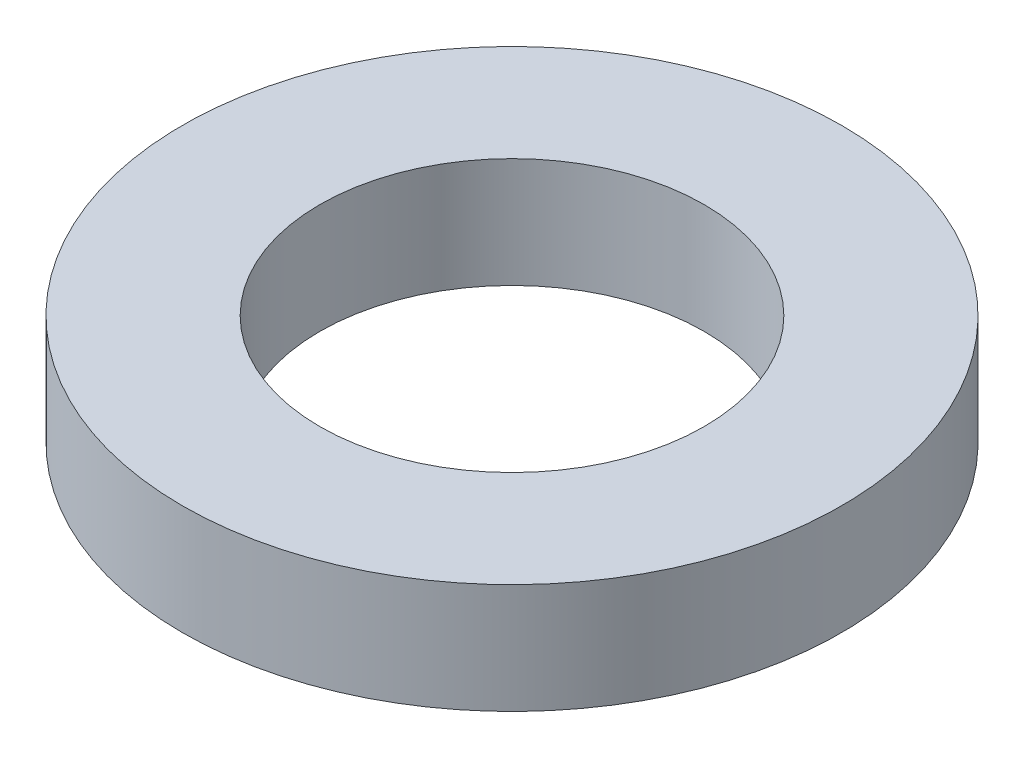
ISO-10303-21;
HEADER;
FILE_DESCRIPTION(('STEP AP214'),'2;1');
FILE_NAME('part.step','',(''),(''),'','','');
FILE_SCHEMA(('AUTOMOTIVE_DESIGN { 1 0 10303 214 1 1 1 1 }'));
ENDSEC;
DATA;
#1=APPLICATION_CONTEXT('core data for automotive mechanical design processes');
#2=APPLICATION_PROTOCOL_DEFINITION('international standard','automotive_design',2000,#1);
#3=PRODUCT_CONTEXT('',#1,'mechanical');
#4=PRODUCT('Part','Part','',(#3));
#5=PRODUCT_RELATED_PRODUCT_CATEGORY('part','',(#4));
#6=PRODUCT_DEFINITION_FORMATION('','',#4);
#7=PRODUCT_DEFINITION_CONTEXT('part definition',#1,'design');
#8=PRODUCT_DEFINITION('design','',#6,#7);
#9=PRODUCT_DEFINITION_SHAPE('','',#8);
#10=(LENGTH_UNIT() NAMED_UNIT(*) SI_UNIT(.MILLI.,.METRE.));
#11=(NAMED_UNIT(*) PLANE_ANGLE_UNIT() SI_UNIT($,.RADIAN.));
#12=(NAMED_UNIT(*) SI_UNIT($,.STERADIAN.) SOLID_ANGLE_UNIT());
#13=UNCERTAINTY_MEASURE_WITH_UNIT(LENGTH_MEASURE(1.E-05),#10,'distance_accuracy_value','');
#14=(GEOMETRIC_REPRESENTATION_CONTEXT(3) GLOBAL_UNCERTAINTY_ASSIGNED_CONTEXT((#13)) GLOBAL_UNIT_ASSIGNED_CONTEXT((#10,
#11,#12)) REPRESENTATION_CONTEXT('',''));
#15=CARTESIAN_POINT('',(0.,0.,0.));
#16=DIRECTION('',(0.,0.,1.));
#17=DIRECTION('',(1.,0.,0.));
#18=AXIS2_PLACEMENT_3D('',#15,#16,#17);
#19=CARTESIAN_POINT('',(0.,6.35,0.));
#20=DIRECTION('',(0.,1.,0.));
#21=DIRECTION('',(0.,0.,1.));
#22=AXIS2_PLACEMENT_3D('',#19,#20,#21);
#23=PLANE('',#22);
#24=CARTESIAN_POINT('',(0.,6.35,0.));
#25=DIRECTION('',(0.,1.,0.));
#26=DIRECTION('',(0.,0.,1.));
#27=AXIS2_PLACEMENT_3D('',#24,#25,#26);
#28=CIRCLE('',#27,19.05);
#29=CARTESIAN_POINT('',(0.,6.35,19.05));
#30=VERTEX_POINT('',#29);
#31=EDGE_CURVE('E10',#30,#30,#28,.T.);
#32=ORIENTED_EDGE('',*,*,#31,.T.);
#33=EDGE_LOOP('',(#32));
#34=FACE_BOUND('',#33,.T.);
#35=CARTESIAN_POINT('',(0.,6.35,0.));
#36=DIRECTION('',(0.,1.,0.));
#37=DIRECTION('',(0.,0.,1.));
#38=AXIS2_PLACEMENT_3D('',#35,#36,#37);
#39=CIRCLE('',#38,11.1125);
#40=CARTESIAN_POINT('',(0.,6.35,11.1125));
#41=VERTEX_POINT('',#40);
#42=EDGE_CURVE('E42',#41,#41,#39,.T.);
#43=ORIENTED_EDGE('',*,*,#42,.F.);
#44=EDGE_LOOP('',(#43));
#45=FACE_BOUND('',#44,.T.);
#46=ADVANCED_FACE('F31',(#34,#45),#23,.T.);
#47=CARTESIAN_POINT('',(0.,0.,0.));
#48=DIRECTION('',(0.,1.,0.));
#49=DIRECTION('',(0.,0.,1.));
#50=AXIS2_PLACEMENT_3D('',#47,#48,#49);
#51=PLANE('',#50);
#52=CARTESIAN_POINT('',(0.,0.,0.));
#53=DIRECTION('',(0.,1.,0.));
#54=DIRECTION('',(0.,0.,1.));
#55=AXIS2_PLACEMENT_3D('',#52,#53,#54);
#56=CIRCLE('',#55,19.05);
#57=CARTESIAN_POINT('',(0.,0.,19.05));
#58=VERTEX_POINT('',#57);
#59=EDGE_CURVE('E35',#58,#58,#56,.T.);
#60=ORIENTED_EDGE('',*,*,#59,.F.);
#61=EDGE_LOOP('',(#60));
#62=FACE_BOUND('',#61,.T.);
#63=CARTESIAN_POINT('',(0.,0.,0.));
#64=DIRECTION('',(0.,1.,0.));
#65=DIRECTION('',(0.,0.,1.));
#66=AXIS2_PLACEMENT_3D('',#63,#64,#65);
#67=CIRCLE('',#66,11.1125);
#68=CARTESIAN_POINT('',(0.,0.,11.1125));
#69=VERTEX_POINT('',#68);
#70=EDGE_CURVE('E44',#69,#69,#67,.T.);
#71=ORIENTED_EDGE('',*,*,#70,.T.);
#72=EDGE_LOOP('',(#71));
#73=FACE_BOUND('',#72,.T.);
#74=ADVANCED_FACE('F54',(#62,#73),#51,.F.);
#75=CARTESIAN_POINT('',(0.,6.35,0.));
#76=DIRECTION('',(0.,-1.,0.));
#77=DIRECTION('',(0.,0.,-1.));
#78=AXIS2_PLACEMENT_3D('',#75,#76,#77);
#79=CYLINDRICAL_SURFACE('',#78,19.05);
#80=ORIENTED_EDGE('',*,*,#31,.F.);
#81=EDGE_LOOP('',(#80));
#82=FACE_BOUND('',#81,.T.);
#83=ORIENTED_EDGE('',*,*,#59,.T.);
#84=EDGE_LOOP('',(#83));
#85=FACE_BOUND('',#84,.T.);
#86=ADVANCED_FACE('F33',(#82,#85),#79,.T.);
#87=CARTESIAN_POINT('',(0.,6.35,0.));
#88=DIRECTION('',(0.,-1.,0.));
#89=DIRECTION('',(0.,0.,-1.));
#90=AXIS2_PLACEMENT_3D('',#87,#88,#89);
#91=CYLINDRICAL_SURFACE('',#90,11.1125);
#92=ORIENTED_EDGE('',*,*,#42,.T.);
#93=EDGE_LOOP('',(#92));
#94=FACE_BOUND('',#93,.T.);
#95=ORIENTED_EDGE('',*,*,#70,.F.);
#96=EDGE_LOOP('',(#95));
#97=FACE_BOUND('',#96,.T.);
#98=ADVANCED_FACE('F50',(#94,#97),#91,.F.);
#99=CLOSED_SHELL('',(#46,#74,#86,#98));
#100=MANIFOLD_SOLID_BREP('B2',#99);
#101=ADVANCED_BREP_SHAPE_REPRESENTATION('',(#18,#100),#14);
#102=SHAPE_DEFINITION_REPRESENTATION(#9,#101);
ENDSEC;
END-ISO-10303-21;
